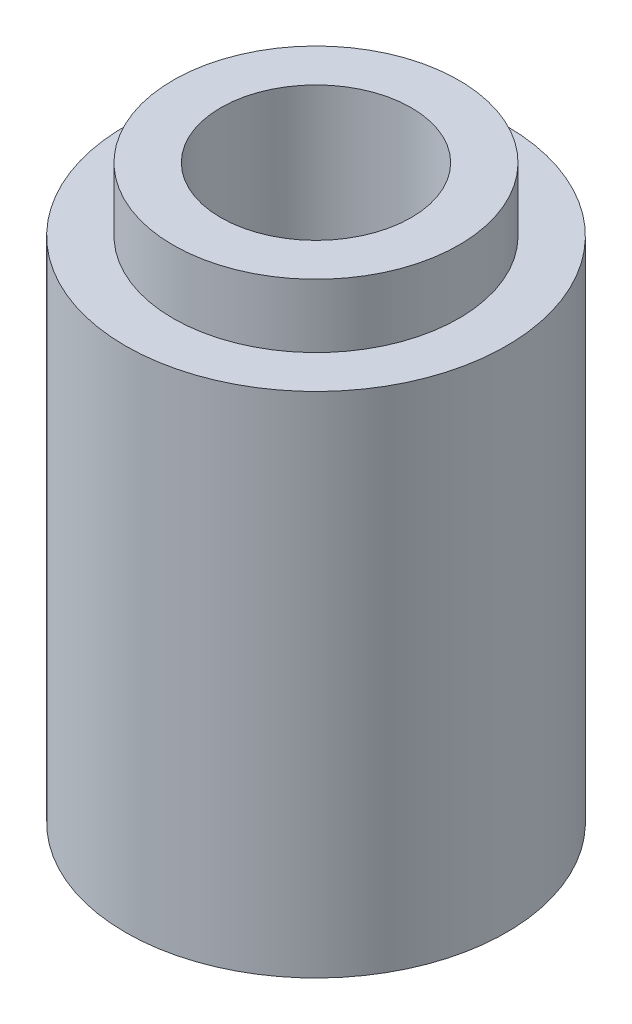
from build123d import *

# Parameters (mm, degrees)
SKETCH_1_R          = 3
EXTRUDE_1_DEPTH     = 8
SKETCH_2_R          = 2.25
EXTRUDE_2_DEPTH     = 1
SKETCH_3_R          = 1.5
CUT_EXTRUDE_1_DEPTH = 9


with BuildPart() as part:
    # Sketch 1 → Extrude 1 (new body)
    with BuildSketch(Plane(origin=(0, 0, 0), x_dir=(1, 0, 0), z_dir=(0, 1, 0))):
        with Locations(Location((0, 0, 0), (0, 0, 270))):
            Circle(SKETCH_1_R)
    extrude(amount=EXTRUDE_1_DEPTH)

    # Sketch 2 → Extrude 2 (add)
    with BuildSketch(Plane(origin=(0, 8, 0), x_dir=(1, 0, 0), z_dir=(0, 1, 0))):
        with Locations(Location((0, 0, 0), (0, 0, 270))):
            Circle(SKETCH_2_R)
    extrude(amount=EXTRUDE_2_DEPTH)

    # Sketch 3 → Cut-Extrude 1 (cut)
    with BuildSketch(Plane.XZ):
        with Locations(Location((0, 0, 0), (0, 0, 270))):
            Circle(SKETCH_3_R)
    extrude(amount=-CUT_EXTRUDE_1_DEPTH, mode=Mode.SUBTRACT)


solid = part.part
